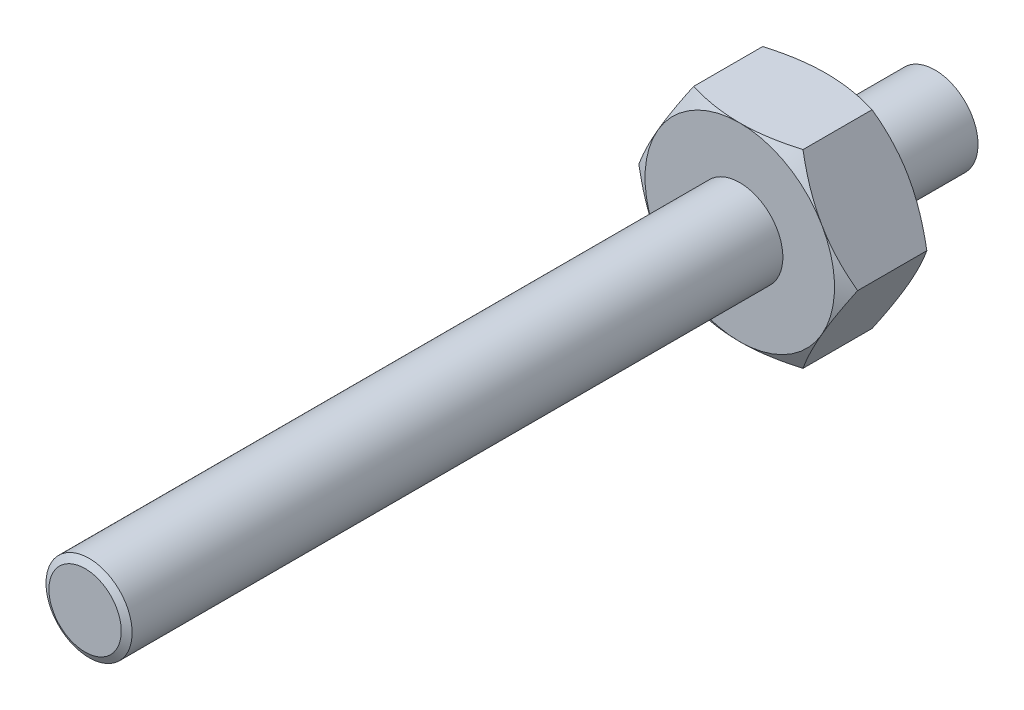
from build123d import *

# Parameters (mm, degrees)
BASE_EXTRUSION_DEPTH = 100
CHANFREIN1_SIZE      = 0.8
CHANFREIN1_SIZE2     = 0.461880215


with BuildPart() as part:
    # Esquisse1 → Base-Extrusion (new body)
    with BuildSketch(Plane.XY):
        Polygon((-6.350852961, 11), (6.350852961, 11), (12.701705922, 0), (6.350852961, -11), (-6.350852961, -11), (-12.701705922, 0), align=None)
    extrude(amount=BASE_EXTRUSION_DEPTH)

    # Esquisse2 → Enl_vement de mati_re-R_volution1 (revolve, cut)
    with BuildSketch(Plane(origin=(0, 0, 0), x_dir=(0, 0, -1), z_dir=(1, 0, 0)), mode=Mode.PRIVATE) as enl_vement_de_mati_re_r_volution1_sk:
        Polygon((-14, 13.5), (-14, 5), (0, 5), (0, 17), (-110, 17), (-110, 5), (-24, 5), (-24, 13.5), align=None)
    revolve(enl_vement_de_mati_re_r_volution1_sk.sketch.rotate(Axis((0, 0, 0), (0, 0, 1)), 90), axis=Axis((0, 0, 0), (0, 0, 1)), mode=Mode.SUBTRACT)

    # Esquisse4 → Enl_vement de mati_re-R_volution2 (revolve, cut)
    with BuildSketch(Plane(origin=(0, 0, 0), x_dir=(0, 0, -1), z_dir=(1, 0, 0)), mode=Mode.PRIVATE) as enl_vement_de_mati_re_r_volution2_sk:
        with BuildLine():
            Line((-3.82667949, 7.867125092), (0, 7.867125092))
            Line((0, 7.867125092), (0, 0.05))
            ThreePointArc((0, 0.05), (-1.018287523, 4.396713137), (-3.82667949, 7.867125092))
        make_face()
    revolve(enl_vement_de_mati_re_r_volution2_sk.sketch.rotate(Axis((0, 0, 1), (0, 0, 1)), 90), axis=Axis((0, 0, 1), (0, 0, 1)), mode=Mode.SUBTRACT)

    # Chanfrein1
    chanfrein1_edges = [part.edges().sort_by_distance(p)[0] for p in [
        (5, 0, 100),
    ]]
    chanfrein1_side = [part.faces().sort_by_distance(p)[0] for p in [
        (0, 0, 100),
    ]]
    chamfer(chanfrein1_edges, length=CHANFREIN1_SIZE, length2=CHANFREIN1_SIZE2, reference=chanfrein1_side[0])

    # Esquisse5 → Enl_vement de mati_re-R_volution3 (revolve, cut)
    with BuildSketch(Plane(origin=(0, 0, 0), x_dir=(0, 0, -1), z_dir=(1, 0, 0))):
        Polygon((-14, 11), (-15.067520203, 12.848999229), (-22.932479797, 12.848999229), (-24, 11), (-24, 14.186835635), (-14, 14.186835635), align=None)
    revolve(axis=Axis((0, 0, 0), (0, 0, 1)), mode=Mode.SUBTRACT)


solid = part.part
